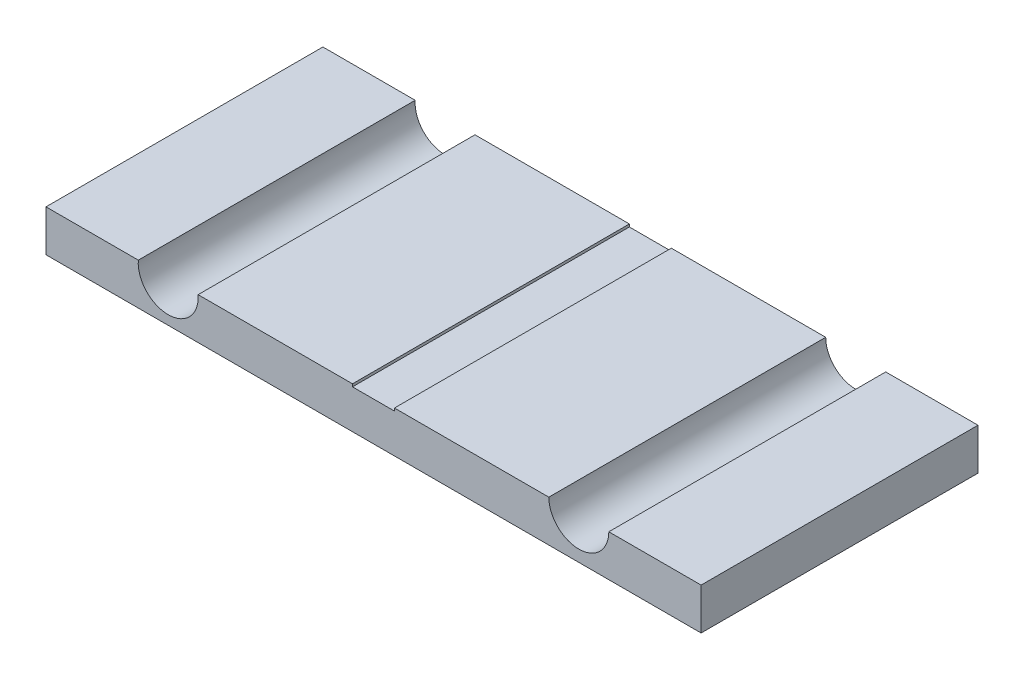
ISO-10303-21;
HEADER;
FILE_DESCRIPTION(('STEP AP214'),'2;1');
FILE_NAME('part.step','',(''),(''),'','','');
FILE_SCHEMA(('AUTOMOTIVE_DESIGN { 1 0 10303 214 1 1 1 1 }'));
ENDSEC;
DATA;
#1=APPLICATION_CONTEXT('core data for automotive mechanical design processes');
#2=APPLICATION_PROTOCOL_DEFINITION('international standard','automotive_design',2000,#1);
#3=PRODUCT_CONTEXT('',#1,'mechanical');
#4=PRODUCT('Part','Part','',(#3));
#5=PRODUCT_RELATED_PRODUCT_CATEGORY('part','',(#4));
#6=PRODUCT_DEFINITION_FORMATION('','',#4);
#7=PRODUCT_DEFINITION_CONTEXT('part definition',#1,'design');
#8=PRODUCT_DEFINITION('design','',#6,#7);
#9=PRODUCT_DEFINITION_SHAPE('','',#8);
#10=(LENGTH_UNIT() NAMED_UNIT(*) SI_UNIT(.MILLI.,.METRE.));
#11=(NAMED_UNIT(*) PLANE_ANGLE_UNIT() SI_UNIT($,.RADIAN.));
#12=(NAMED_UNIT(*) SI_UNIT($,.STERADIAN.) SOLID_ANGLE_UNIT());
#13=UNCERTAINTY_MEASURE_WITH_UNIT(LENGTH_MEASURE(1.E-05),#10,'distance_accuracy_value','');
#14=(GEOMETRIC_REPRESENTATION_CONTEXT(3) GLOBAL_UNCERTAINTY_ASSIGNED_CONTEXT((#13)) GLOBAL_UNIT_ASSIGNED_CONTEXT((#10,
#11,#12)) REPRESENTATION_CONTEXT('',''));
#15=CARTESIAN_POINT('',(0.,0.,0.));
#16=DIRECTION('',(0.,0.,1.));
#17=DIRECTION('',(1.,0.,0.));
#18=AXIS2_PLACEMENT_3D('',#15,#16,#17);
#19=CARTESIAN_POINT('',(-32.1116427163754,-3.96541487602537,-60.));
#20=DIRECTION('',(-1.,0.,0.));
#21=DIRECTION('',(0.,0.,1.));
#22=AXIS2_PLACEMENT_3D('',#19,#20,#21);
#23=PLANE('',#22);
#24=DIRECTION('',(0.,-1.,0.));
#25=VECTOR('',#24,1.);
#26=CARTESIAN_POINT('',(-32.1116427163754,-3.96541487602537,0.));
#27=LINE('',#26,#25);
#28=CARTESIAN_POINT('',(-32.1116427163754,-3.96541487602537,0.));
#29=VERTEX_POINT('',#28);
#30=CARTESIAN_POINT('',(-32.1116427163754,-12.9654148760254,0.));
#31=VERTEX_POINT('',#30);
#32=EDGE_CURVE('E154',#29,#31,#27,.T.);
#33=ORIENTED_EDGE('',*,*,#32,.F.);
#34=DIRECTION('',(0.,0.,1.));
#35=VECTOR('',#34,1.);
#36=CARTESIAN_POINT('',(-32.1116427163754,-3.96541487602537,-60.));
#37=LINE('',#36,#35);
#38=CARTESIAN_POINT('',(-32.1116427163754,-3.96541487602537,-60.));
#39=VERTEX_POINT('',#38);
#40=EDGE_CURVE('E11',#39,#29,#37,.T.);
#41=ORIENTED_EDGE('',*,*,#40,.F.);
#42=DIRECTION('',(0.,-1.,0.));
#43=VECTOR('',#42,1.);
#44=CARTESIAN_POINT('',(-32.1116427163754,-3.96541487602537,-60.));
#45=LINE('',#44,#43);
#46=CARTESIAN_POINT('',(-32.1116427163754,-12.9654148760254,-60.));
#47=VERTEX_POINT('',#46);
#48=EDGE_CURVE('E186',#39,#47,#45,.T.);
#49=ORIENTED_EDGE('',*,*,#48,.T.);
#50=DIRECTION('',(0.,0.,1.));
#51=VECTOR('',#50,1.);
#52=CARTESIAN_POINT('',(-32.1116427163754,-12.9654148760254,-60.));
#53=LINE('',#52,#51);
#54=EDGE_CURVE('E36',#47,#31,#53,.T.);
#55=ORIENTED_EDGE('',*,*,#54,.T.);
#56=EDGE_LOOP('',(#33,#41,#49,#55));
#57=FACE_BOUND('',#56,.T.);
#58=ADVANCED_FACE('F33',(#57),#23,.T.);
#59=CARTESIAN_POINT('',(-32.1116427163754,-3.96541487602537,-60.));
#60=DIRECTION('',(0.,1.,0.));
#61=DIRECTION('',(-1.,0.,0.));
#62=AXIS2_PLACEMENT_3D('',#59,#60,#61);
#63=PLANE('',#62);
#64=DIRECTION('',(-1.,0.,0.));
#65=VECTOR('',#64,1.);
#66=CARTESIAN_POINT('',(-32.1116427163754,-3.96541487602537,0.));
#67=LINE('',#66,#65);
#68=CARTESIAN_POINT('',(-12.1116427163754,-3.96541487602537,0.));
#69=VERTEX_POINT('',#68);
#70=EDGE_CURVE('E184',#69,#29,#67,.T.);
#71=ORIENTED_EDGE('',*,*,#70,.F.);
#72=DIRECTION('',(0.,0.,1.));
#73=VECTOR('',#72,1.);
#74=CARTESIAN_POINT('',(-12.1116427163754,-3.96541487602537,-60.));
#75=LINE('',#74,#73);
#76=CARTESIAN_POINT('',(-12.1116427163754,-3.96541487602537,-60.));
#77=VERTEX_POINT('',#76);
#78=EDGE_CURVE('E42',#77,#69,#75,.T.);
#79=ORIENTED_EDGE('',*,*,#78,.F.);
#80=DIRECTION('',(-1.,0.,0.));
#81=VECTOR('',#80,1.);
#82=CARTESIAN_POINT('',(-32.1116427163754,-3.96541487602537,-60.));
#83=LINE('',#82,#81);
#84=EDGE_CURVE('E144',#77,#39,#83,.T.);
#85=ORIENTED_EDGE('',*,*,#84,.T.);
#86=ORIENTED_EDGE('',*,*,#40,.T.);
#87=EDGE_LOOP('',(#71,#79,#85,#86));
#88=FACE_BOUND('',#87,.T.);
#89=ADVANCED_FACE('F206',(#88),#63,.T.);
#90=CARTESIAN_POINT('',(-5.63126689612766,-4.47012194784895,-60.));
#91=DIRECTION('',(0.,0.,1.));
#92=DIRECTION('',(1.,0.,0.));
#93=AXIS2_PLACEMENT_3D('',#90,#91,#92);
#94=CYLINDRICAL_SURFACE('',#93,6.5);
#95=CARTESIAN_POINT('',(-5.63126689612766,-4.47012194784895,0.));
#96=DIRECTION('',(0.,0.,-1.));
#97=DIRECTION('',(1.,0.,0.));
#98=AXIS2_PLACEMENT_3D('',#95,#96,#97);
#99=CIRCLE('',#98,6.5);
#100=CARTESIAN_POINT('',(0.84910892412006,-3.96541487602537,0.));
#101=VERTEX_POINT('',#100);
#102=EDGE_CURVE('E131',#101,#69,#99,.T.);
#103=ORIENTED_EDGE('',*,*,#102,.F.);
#104=DIRECTION('',(0.,0.,1.));
#105=VECTOR('',#104,1.);
#106=CARTESIAN_POINT('',(0.84910892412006,-3.96541487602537,-60.));
#107=LINE('',#106,#105);
#108=CARTESIAN_POINT('',(0.84910892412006,-3.96541487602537,-60.));
#109=VERTEX_POINT('',#108);
#110=EDGE_CURVE('E126',#109,#101,#107,.T.);
#111=ORIENTED_EDGE('',*,*,#110,.F.);
#112=CARTESIAN_POINT('',(-5.63126689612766,-4.47012194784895,-60.));
#113=DIRECTION('',(0.,0.,-1.));
#114=DIRECTION('',(1.,0.,0.));
#115=AXIS2_PLACEMENT_3D('',#112,#113,#114);
#116=CIRCLE('',#115,6.5);
#117=EDGE_CURVE('E129',#109,#77,#116,.T.);
#118=ORIENTED_EDGE('',*,*,#117,.T.);
#119=ORIENTED_EDGE('',*,*,#78,.T.);
#120=EDGE_LOOP('',(#103,#111,#118,#119));
#121=FACE_BOUND('',#120,.T.);
#122=ADVANCED_FACE('F128',(#121),#94,.F.);
#123=CARTESIAN_POINT('',(0.849108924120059,-3.96541487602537,-60.));
#124=DIRECTION('',(0.,1.,0.));
#125=DIRECTION('',(0.,0.,1.));
#126=AXIS2_PLACEMENT_3D('',#123,#124,#125);
#127=PLANE('',#126);
#128=DIRECTION('',(-1.,0.,0.));
#129=VECTOR('',#128,1.);
#130=CARTESIAN_POINT('',(0.849108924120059,-3.96541487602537,0.));
#131=LINE('',#130,#129);
#132=CARTESIAN_POINT('',(34.3041089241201,-3.96541487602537,0.));
#133=VERTEX_POINT('',#132);
#134=EDGE_CURVE('E181',#133,#101,#131,.T.);
#135=ORIENTED_EDGE('',*,*,#134,.F.);
#136=DIRECTION('',(0.,0.,1.));
#137=VECTOR('',#136,1.);
#138=CARTESIAN_POINT('',(34.3041089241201,-3.96541487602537,-60.));
#139=LINE('',#138,#137);
#140=CARTESIAN_POINT('',(34.3041089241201,-3.96541487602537,-60.));
#141=VERTEX_POINT('',#140);
#142=EDGE_CURVE('E136',#141,#133,#139,.T.);
#143=ORIENTED_EDGE('',*,*,#142,.F.);
#144=DIRECTION('',(-1.,0.,0.));
#145=VECTOR('',#144,1.);
#146=CARTESIAN_POINT('',(0.849108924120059,-3.96541487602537,-60.));
#147=LINE('',#146,#145);
#148=EDGE_CURVE('E142',#141,#109,#147,.T.);
#149=ORIENTED_EDGE('',*,*,#148,.T.);
#150=ORIENTED_EDGE('',*,*,#110,.T.);
#151=EDGE_LOOP('',(#135,#143,#149,#150));
#152=FACE_BOUND('',#151,.T.);
#153=ADVANCED_FACE('F146',(#152),#127,.T.);
#154=CARTESIAN_POINT('',(34.3041089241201,-3.96541487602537,-60.));
#155=DIRECTION('',(1.,0.,0.));
#156=DIRECTION('',(0.,0.,-1.));
#157=AXIS2_PLACEMENT_3D('',#154,#155,#156);
#158=PLANE('',#157);
#159=DIRECTION('',(0.,1.,0.));
#160=VECTOR('',#159,1.);
#161=CARTESIAN_POINT('',(34.3041089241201,-3.96541487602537,0.));
#162=LINE('',#161,#160);
#163=CARTESIAN_POINT('',(34.3041089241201,-4.54041487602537,0.));
#164=VERTEX_POINT('',#163);
#165=EDGE_CURVE('E178',#164,#133,#162,.T.);
#166=ORIENTED_EDGE('',*,*,#165,.F.);
#167=DIRECTION('',(0.,0.,1.));
#168=VECTOR('',#167,1.);
#169=CARTESIAN_POINT('',(34.3041089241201,-4.54041487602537,-60.));
#170=LINE('',#169,#168);
#171=CARTESIAN_POINT('',(34.3041089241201,-4.54041487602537,-60.));
#172=VERTEX_POINT('',#171);
#173=EDGE_CURVE('E190',#172,#164,#170,.T.);
#174=ORIENTED_EDGE('',*,*,#173,.F.);
#175=DIRECTION('',(0.,1.,0.));
#176=VECTOR('',#175,1.);
#177=CARTESIAN_POINT('',(34.3041089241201,-3.96541487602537,-60.));
#178=LINE('',#177,#176);
#179=EDGE_CURVE('E147',#172,#141,#178,.T.);
#180=ORIENTED_EDGE('',*,*,#179,.T.);
#181=ORIENTED_EDGE('',*,*,#142,.T.);
#182=EDGE_LOOP('',(#166,#174,#180,#181));
#183=FACE_BOUND('',#182,.T.);
#184=ADVANCED_FACE('F219',(#183),#158,.T.);
#185=CARTESIAN_POINT('',(43.3941089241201,-4.54041487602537,-60.));
#186=DIRECTION('',(0.,1.,0.));
#187=DIRECTION('',(-1.,0.,0.));
#188=AXIS2_PLACEMENT_3D('',#185,#186,#187);
#189=PLANE('',#188);
#190=DIRECTION('',(-1.,0.,0.));
#191=VECTOR('',#190,1.);
#192=CARTESIAN_POINT('',(43.3941089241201,-4.54041487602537,0.));
#193=LINE('',#192,#191);
#194=CARTESIAN_POINT('',(43.3941089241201,-4.54041487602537,0.));
#195=VERTEX_POINT('',#194);
#196=EDGE_CURVE('E175',#195,#164,#193,.T.);
#197=ORIENTED_EDGE('',*,*,#196,.F.);
#198=DIRECTION('',(0.,0.,1.));
#199=VECTOR('',#198,1.);
#200=CARTESIAN_POINT('',(43.3941089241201,-4.54041487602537,-60.));
#201=LINE('',#200,#199);
#202=CARTESIAN_POINT('',(43.3941089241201,-4.54041487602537,-60.));
#203=VERTEX_POINT('',#202);
#204=EDGE_CURVE('E192',#203,#195,#201,.T.);
#205=ORIENTED_EDGE('',*,*,#204,.F.);
#206=DIRECTION('',(-1.,0.,0.));
#207=VECTOR('',#206,1.);
#208=CARTESIAN_POINT('',(43.3941089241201,-4.54041487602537,-60.));
#209=LINE('',#208,#207);
#210=EDGE_CURVE('E149',#203,#172,#209,.T.);
#211=ORIENTED_EDGE('',*,*,#210,.T.);
#212=ORIENTED_EDGE('',*,*,#173,.T.);
#213=EDGE_LOOP('',(#197,#205,#211,#212));
#214=FACE_BOUND('',#213,.T.);
#215=ADVANCED_FACE('F222',(#214),#189,.T.);
#216=CARTESIAN_POINT('',(43.3941089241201,-3.96541487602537,-60.));
#217=DIRECTION('',(-1.,0.,0.));
#218=DIRECTION('',(0.,0.,1.));
#219=AXIS2_PLACEMENT_3D('',#216,#217,#218);
#220=PLANE('',#219);
#221=DIRECTION('',(0.,-1.,0.));
#222=VECTOR('',#221,1.);
#223=CARTESIAN_POINT('',(43.3941089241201,-3.96541487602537,0.));
#224=LINE('',#223,#222);
#225=CARTESIAN_POINT('',(43.3941089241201,-3.96541487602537,0.));
#226=VERTEX_POINT('',#225);
#227=EDGE_CURVE('E172',#226,#195,#224,.T.);
#228=ORIENTED_EDGE('',*,*,#227,.F.);
#229=DIRECTION('',(0.,0.,1.));
#230=VECTOR('',#229,1.);
#231=CARTESIAN_POINT('',(43.3941089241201,-3.96541487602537,-60.));
#232=LINE('',#231,#230);
#233=CARTESIAN_POINT('',(43.3941089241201,-3.96541487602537,-60.));
#234=VERTEX_POINT('',#233);
#235=EDGE_CURVE('E194',#234,#226,#232,.T.);
#236=ORIENTED_EDGE('',*,*,#235,.F.);
#237=DIRECTION('',(0.,-1.,0.));
#238=VECTOR('',#237,1.);
#239=CARTESIAN_POINT('',(43.3941089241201,-3.96541487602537,-60.));
#240=LINE('',#239,#238);
#241=EDGE_CURVE('E348',#234,#203,#240,.T.);
#242=ORIENTED_EDGE('',*,*,#241,.T.);
#243=ORIENTED_EDGE('',*,*,#204,.T.);
#244=EDGE_LOOP('',(#228,#236,#242,#243));
#245=FACE_BOUND('',#244,.T.);
#246=ADVANCED_FACE('F226',(#245),#220,.T.);
#247=CARTESIAN_POINT('',(43.3941089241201,-3.96541487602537,-60.));
#248=DIRECTION('',(0.,1.,0.));
#249=DIRECTION('',(0.,0.,1.));
#250=AXIS2_PLACEMENT_3D('',#247,#248,#249);
#251=PLANE('',#250);
#252=DIRECTION('',(-1.,0.,0.));
#253=VECTOR('',#252,1.);
#254=CARTESIAN_POINT('',(43.3941089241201,-3.96541487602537,0.));
#255=LINE('',#254,#253);
#256=CARTESIAN_POINT('',(76.8491089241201,-3.96541487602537,0.));
#257=VERTEX_POINT('',#256);
#258=EDGE_CURVE('E169',#257,#226,#255,.T.);
#259=ORIENTED_EDGE('',*,*,#258,.F.);
#260=DIRECTION('',(0.,0.,1.));
#261=VECTOR('',#260,1.);
#262=CARTESIAN_POINT('',(76.8491089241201,-3.96541487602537,-60.));
#263=LINE('',#262,#261);
#264=CARTESIAN_POINT('',(76.8491089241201,-3.96541487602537,-60.));
#265=VERTEX_POINT('',#264);
#266=EDGE_CURVE('E196',#265,#257,#263,.T.);
#267=ORIENTED_EDGE('',*,*,#266,.F.);
#268=DIRECTION('',(-1.,0.,0.));
#269=VECTOR('',#268,1.);
#270=CARTESIAN_POINT('',(43.3941089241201,-3.96541487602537,-60.));
#271=LINE('',#270,#269);
#272=EDGE_CURVE('E352',#265,#234,#271,.T.);
#273=ORIENTED_EDGE('',*,*,#272,.T.);
#274=ORIENTED_EDGE('',*,*,#235,.T.);
#275=EDGE_LOOP('',(#259,#267,#273,#274));
#276=FACE_BOUND('',#275,.T.);
#277=ADVANCED_FACE('F230',(#276),#251,.T.);
#278=CARTESIAN_POINT('',(83.3491089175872,-3.96512345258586,-60.));
#279=DIRECTION('',(0.,0.,1.));
#280=DIRECTION('',(1.,0.,0.));
#281=AXIS2_PLACEMENT_3D('',#278,#279,#280);
#282=CYLINDRICAL_SURFACE('',#281,6.5);
#283=CARTESIAN_POINT('',(83.3491089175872,-3.96512345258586,0.));
#284=DIRECTION('',(0.,0.,-1.));
#285=DIRECTION('',(1.,0.,0.));
#286=AXIS2_PLACEMENT_3D('',#283,#284,#285);
#287=CIRCLE('',#286,6.5);
#288=CARTESIAN_POINT('',(89.8491089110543,-3.96541487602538,0.));
#289=VERTEX_POINT('',#288);
#290=EDGE_CURVE('E166',#289,#257,#287,.T.);
#291=ORIENTED_EDGE('',*,*,#290,.F.);
#292=DIRECTION('',(0.,0.,1.));
#293=VECTOR('',#292,1.);
#294=CARTESIAN_POINT('',(89.8491089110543,-3.96541487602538,-60.));
#295=LINE('',#294,#293);
#296=CARTESIAN_POINT('',(89.8491089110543,-3.96541487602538,-60.));
#297=VERTEX_POINT('',#296);
#298=EDGE_CURVE('E198',#297,#289,#295,.T.);
#299=ORIENTED_EDGE('',*,*,#298,.F.);
#300=CARTESIAN_POINT('',(83.3491089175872,-3.96512345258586,-60.));
#301=DIRECTION('',(0.,0.,-1.));
#302=DIRECTION('',(1.,0.,0.));
#303=AXIS2_PLACEMENT_3D('',#300,#301,#302);
#304=CIRCLE('',#303,6.5);
#305=EDGE_CURVE('E341',#297,#265,#304,.T.);
#306=ORIENTED_EDGE('',*,*,#305,.T.);
#307=ORIENTED_EDGE('',*,*,#266,.T.);
#308=EDGE_LOOP('',(#291,#299,#306,#307));
#309=FACE_BOUND('',#308,.T.);
#310=ADVANCED_FACE('F234',(#309),#282,.F.);
#311=CARTESIAN_POINT('',(89.8491089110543,-3.96541487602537,-60.));
#312=DIRECTION('',(0.,1.,0.));
#313=DIRECTION('',(-1.,0.,0.));
#314=AXIS2_PLACEMENT_3D('',#311,#312,#313);
#315=PLANE('',#314);
#316=DIRECTION('',(-1.,0.,0.));
#317=VECTOR('',#316,1.);
#318=CARTESIAN_POINT('',(89.8491089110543,-3.96541487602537,0.));
#319=LINE('',#318,#317);
#320=CARTESIAN_POINT('',(109.849108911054,-3.96541487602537,0.));
#321=VERTEX_POINT('',#320);
#322=EDGE_CURVE('E163',#321,#289,#319,.T.);
#323=ORIENTED_EDGE('',*,*,#322,.F.);
#324=DIRECTION('',(0.,0.,1.));
#325=VECTOR('',#324,1.);
#326=CARTESIAN_POINT('',(109.849108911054,-3.96541487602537,-60.));
#327=LINE('',#326,#325);
#328=CARTESIAN_POINT('',(109.849108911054,-3.96541487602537,-60.));
#329=VERTEX_POINT('',#328);
#330=EDGE_CURVE('E200',#329,#321,#327,.T.);
#331=ORIENTED_EDGE('',*,*,#330,.F.);
#332=DIRECTION('',(-1.,0.,0.));
#333=VECTOR('',#332,1.);
#334=CARTESIAN_POINT('',(89.8491089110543,-3.96541487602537,-60.));
#335=LINE('',#334,#333);
#336=EDGE_CURVE('E337',#329,#297,#335,.T.);
#337=ORIENTED_EDGE('',*,*,#336,.T.);
#338=ORIENTED_EDGE('',*,*,#298,.T.);
#339=EDGE_LOOP('',(#323,#331,#337,#338));
#340=FACE_BOUND('',#339,.T.);
#341=ADVANCED_FACE('F238',(#340),#315,.T.);
#342=CARTESIAN_POINT('',(109.849108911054,-3.96541487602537,-60.));
#343=DIRECTION('',(1.,0.,0.));
#344=DIRECTION('',(0.,1.,0.));
#345=AXIS2_PLACEMENT_3D('',#342,#343,#344);
#346=PLANE('',#345);
#347=DIRECTION('',(0.,1.,0.));
#348=VECTOR('',#347,1.);
#349=CARTESIAN_POINT('',(109.849108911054,-3.96541487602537,0.));
#350=LINE('',#349,#348);
#351=CARTESIAN_POINT('',(109.849108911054,-12.9654148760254,0.));
#352=VERTEX_POINT('',#351);
#353=EDGE_CURVE('E160',#352,#321,#350,.T.);
#354=ORIENTED_EDGE('',*,*,#353,.F.);
#355=DIRECTION('',(0.,0.,1.));
#356=VECTOR('',#355,1.);
#357=CARTESIAN_POINT('',(109.849108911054,-12.9654148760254,-60.));
#358=LINE('',#357,#356);
#359=CARTESIAN_POINT('',(109.849108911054,-12.9654148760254,-60.));
#360=VERTEX_POINT('',#359);
#361=EDGE_CURVE('E201',#360,#352,#358,.T.);
#362=ORIENTED_EDGE('',*,*,#361,.F.);
#363=DIRECTION('',(0.,1.,0.));
#364=VECTOR('',#363,1.);
#365=CARTESIAN_POINT('',(109.849108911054,-3.96541487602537,-60.));
#366=LINE('',#365,#364);
#367=EDGE_CURVE('E358',#360,#329,#366,.T.);
#368=ORIENTED_EDGE('',*,*,#367,.T.);
#369=ORIENTED_EDGE('',*,*,#330,.T.);
#370=EDGE_LOOP('',(#354,#362,#368,#369));
#371=FACE_BOUND('',#370,.T.);
#372=ADVANCED_FACE('F242',(#371),#346,.T.);
#373=CARTESIAN_POINT('',(-32.1116427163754,-12.9654148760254,-60.));
#374=DIRECTION('',(0.,-1.,0.));
#375=DIRECTION('',(0.,0.,-1.));
#376=AXIS2_PLACEMENT_3D('',#373,#374,#375);
#377=PLANE('',#376);
#378=DIRECTION('',(1.,0.,0.));
#379=VECTOR('',#378,1.);
#380=CARTESIAN_POINT('',(-32.1116427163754,-12.9654148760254,0.));
#381=LINE('',#380,#379);
#382=EDGE_CURVE('E157',#31,#352,#381,.T.);
#383=ORIENTED_EDGE('',*,*,#382,.F.);
#384=ORIENTED_EDGE('',*,*,#54,.F.);
#385=DIRECTION('',(1.,0.,0.));
#386=VECTOR('',#385,1.);
#387=CARTESIAN_POINT('',(-32.1116427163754,-12.9654148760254,-60.));
#388=LINE('',#387,#386);
#389=EDGE_CURVE('E360',#47,#360,#388,.T.);
#390=ORIENTED_EDGE('',*,*,#389,.T.);
#391=ORIENTED_EDGE('',*,*,#361,.T.);
#392=EDGE_LOOP('',(#383,#384,#390,#391));
#393=FACE_BOUND('',#392,.T.);
#394=ADVANCED_FACE('F203',(#393),#377,.T.);
#395=CARTESIAN_POINT('',(83.3491089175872,-3.96512345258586,-60.));
#396=DIRECTION('',(0.,0.,1.));
#397=DIRECTION('',(1.,0.,0.));
#398=AXIS2_PLACEMENT_3D('',#395,#396,#397);
#399=PLANE('',#398);
#400=ORIENTED_EDGE('',*,*,#48,.F.);
#401=ORIENTED_EDGE('',*,*,#84,.F.);
#402=ORIENTED_EDGE('',*,*,#117,.F.);
#403=ORIENTED_EDGE('',*,*,#148,.F.);
#404=ORIENTED_EDGE('',*,*,#179,.F.);
#405=ORIENTED_EDGE('',*,*,#210,.F.);
#406=ORIENTED_EDGE('',*,*,#241,.F.);
#407=ORIENTED_EDGE('',*,*,#272,.F.);
#408=ORIENTED_EDGE('',*,*,#305,.F.);
#409=ORIENTED_EDGE('',*,*,#336,.F.);
#410=ORIENTED_EDGE('',*,*,#367,.F.);
#411=ORIENTED_EDGE('',*,*,#389,.F.);
#412=EDGE_LOOP('',(#400,#401,#402,#403,#404,#405,#406,#407,#408,#409,#410,#411));
#413=FACE_BOUND('',#412,.T.);
#414=ADVANCED_FACE('F140',(#413),#399,.F.);
#415=CARTESIAN_POINT('',(83.3491089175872,-3.96512345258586,0.));
#416=DIRECTION('',(0.,0.,1.));
#417=DIRECTION('',(1.,0.,0.));
#418=AXIS2_PLACEMENT_3D('',#415,#416,#417);
#419=PLANE('',#418);
#420=ORIENTED_EDGE('',*,*,#32,.T.);
#421=ORIENTED_EDGE('',*,*,#382,.T.);
#422=ORIENTED_EDGE('',*,*,#353,.T.);
#423=ORIENTED_EDGE('',*,*,#322,.T.);
#424=ORIENTED_EDGE('',*,*,#290,.T.);
#425=ORIENTED_EDGE('',*,*,#258,.T.);
#426=ORIENTED_EDGE('',*,*,#227,.T.);
#427=ORIENTED_EDGE('',*,*,#196,.T.);
#428=ORIENTED_EDGE('',*,*,#165,.T.);
#429=ORIENTED_EDGE('',*,*,#134,.T.);
#430=ORIENTED_EDGE('',*,*,#102,.T.);
#431=ORIENTED_EDGE('',*,*,#70,.T.);
#432=EDGE_LOOP('',(#420,#421,#422,#423,#424,#425,#426,#427,#428,#429,#430,#431));
#433=FACE_BOUND('',#432,.T.);
#434=ADVANCED_FACE('F205',(#433),#419,.T.);
#435=CLOSED_SHELL('',(#58,#89,#122,#153,#184,#215,#246,#277,#310,#341,#372,#394,#414,#434));
#436=MANIFOLD_SOLID_BREP('B2',#435);
#437=ADVANCED_BREP_SHAPE_REPRESENTATION('',(#18,#436),#14);
#438=SHAPE_DEFINITION_REPRESENTATION(#9,#437);
ENDSEC;
END-ISO-10303-21;
